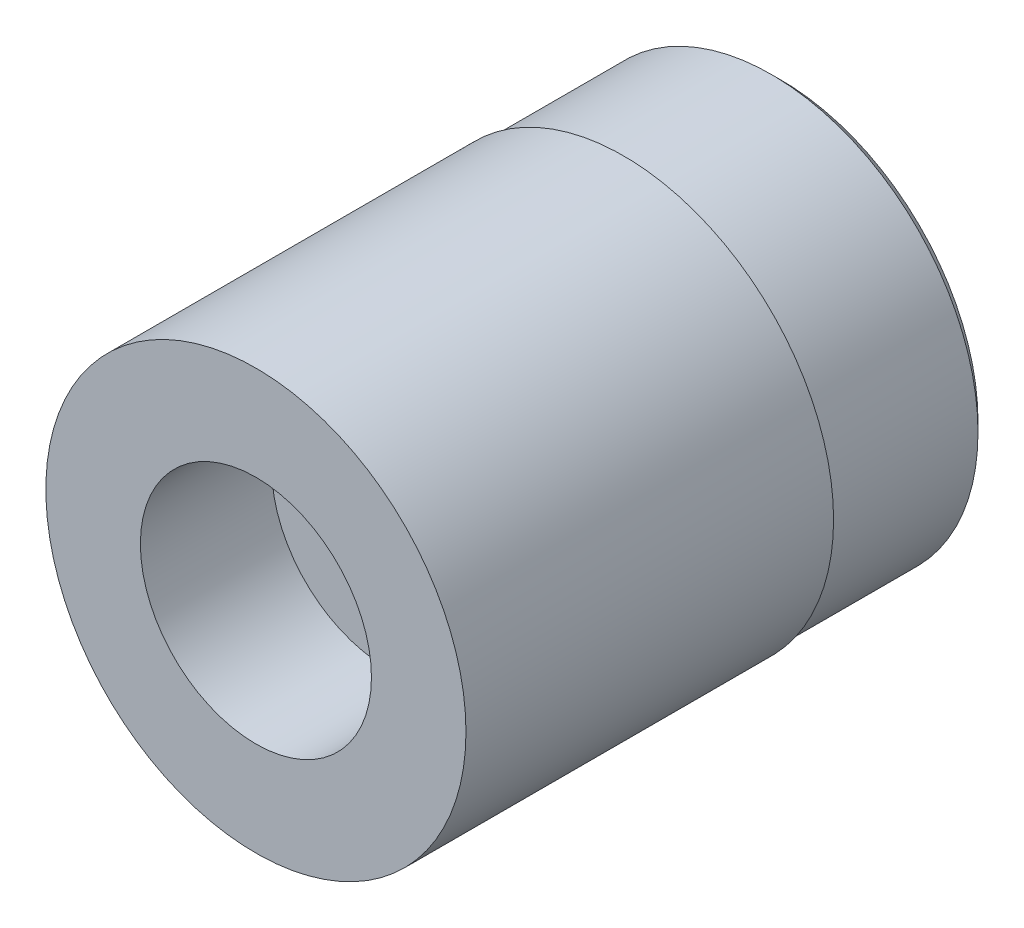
from build123d import *

# Parameters (mm, degrees)
SKETCH4_W = 3
SKETCH4_H = 1


with BuildPart() as part:
    # Sketch1 → Revolve1 (revolve)
    with BuildSketch(Plane(origin=(0, 0, 0), x_dir=(0, 0, -1), z_dir=(1, 0, 0)), mode=Mode.PRIVATE) as revolve1_sk:
        Polygon((0, 4), (0, 2.2), (2.5, 2.2), (2.5, 1.15), (10, 1.15), (10, 3.75), (9.75, 4), align=None)
    revolve(revolve1_sk.sketch.rotate(Axis((0, 0, 3.797909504), (0, 0, -1)), 90), axis=Axis((0, 0, 3.797909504), (0, 0, -1)))

    # Sketch4 → Cut-Revolve1 (revolve, cut)
    with BuildSketch(Plane(origin=(0, 0, 0), x_dir=(0, 0, -1), z_dir=(1, 0, 0)), mode=Mode.PRIVATE) as cut_revolve1_sk:
        with Locations((8.5, 4.435)):
            Rectangle(SKETCH4_W, SKETCH4_H)
    revolve(cut_revolve1_sk.sketch.rotate(Axis((0, 0, 0), (0, 0, -1)), 90), axis=Axis((0, 0, 0), (0, 0, -1)), mode=Mode.SUBTRACT)


solid = part.part
